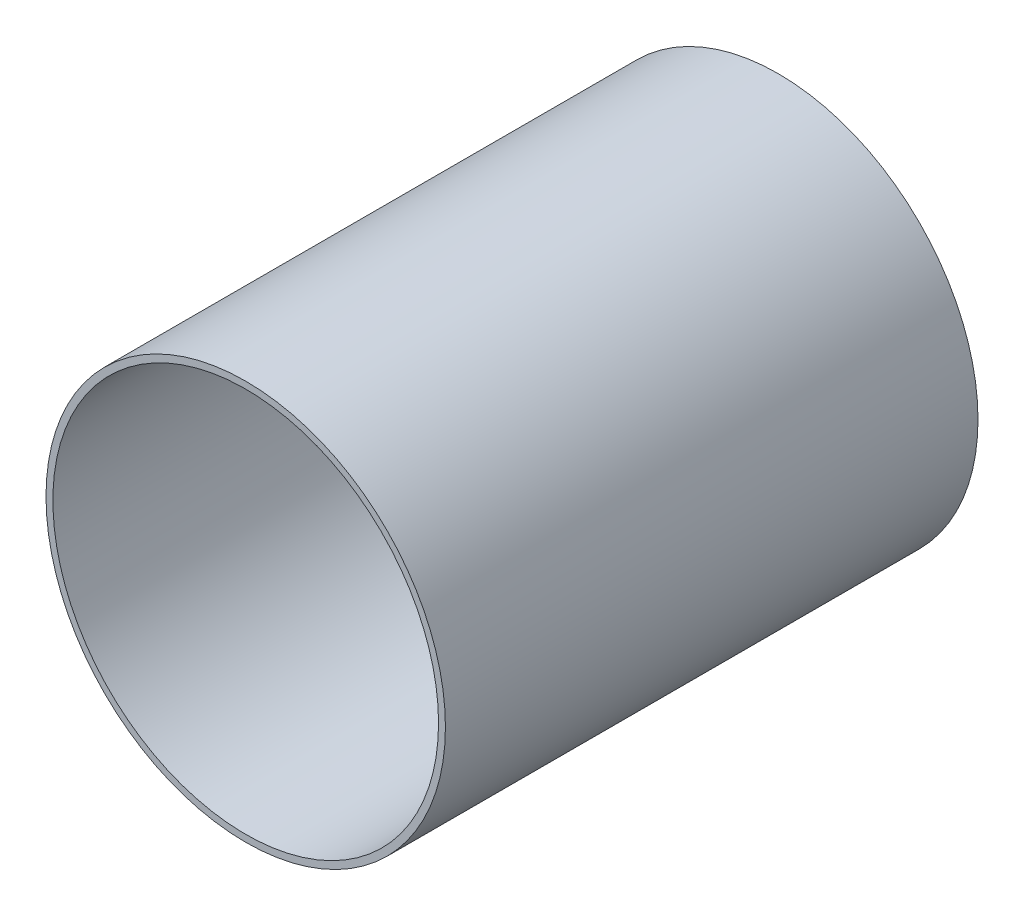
ISO-10303-21;
HEADER;
FILE_DESCRIPTION(('STEP AP214'),'2;1');
FILE_NAME('part.step','',(''),(''),'','','');
FILE_SCHEMA(('AUTOMOTIVE_DESIGN { 1 0 10303 214 1 1 1 1 }'));
ENDSEC;
DATA;
#1=APPLICATION_CONTEXT('core data for automotive mechanical design processes');
#2=APPLICATION_PROTOCOL_DEFINITION('international standard','automotive_design',2000,#1);
#3=PRODUCT_CONTEXT('',#1,'mechanical');
#4=PRODUCT('Part','Part','',(#3));
#5=PRODUCT_RELATED_PRODUCT_CATEGORY('part','',(#4));
#6=PRODUCT_DEFINITION_FORMATION('','',#4);
#7=PRODUCT_DEFINITION_CONTEXT('part definition',#1,'design');
#8=PRODUCT_DEFINITION('design','',#6,#7);
#9=PRODUCT_DEFINITION_SHAPE('','',#8);
#10=(LENGTH_UNIT() NAMED_UNIT(*) SI_UNIT(.MILLI.,.METRE.));
#11=(NAMED_UNIT(*) PLANE_ANGLE_UNIT() SI_UNIT($,.RADIAN.));
#12=(NAMED_UNIT(*) SI_UNIT($,.STERADIAN.) SOLID_ANGLE_UNIT());
#13=UNCERTAINTY_MEASURE_WITH_UNIT(LENGTH_MEASURE(1.E-05),#10,'distance_accuracy_value','');
#14=(GEOMETRIC_REPRESENTATION_CONTEXT(3) GLOBAL_UNCERTAINTY_ASSIGNED_CONTEXT((#13)) GLOBAL_UNIT_ASSIGNED_CONTEXT((#10,
#11,#12)) REPRESENTATION_CONTEXT('',''));
#15=CARTESIAN_POINT('',(0.,0.,0.));
#16=DIRECTION('',(0.,0.,1.));
#17=DIRECTION('',(1.,0.,0.));
#18=AXIS2_PLACEMENT_3D('',#15,#16,#17);
#19=CARTESIAN_POINT('',(0.,0.,203.2));
#20=DIRECTION('',(0.,0.,-1.));
#21=DIRECTION('',(-1.,0.,0.));
#22=AXIS2_PLACEMENT_3D('',#19,#20,#21);
#23=CYLINDRICAL_SURFACE('',#22,76.2);
#24=CARTESIAN_POINT('',(0.,0.,203.2));
#25=DIRECTION('',(0.,0.,1.));
#26=DIRECTION('',(1.,0.,0.));
#27=AXIS2_PLACEMENT_3D('',#24,#25,#26);
#28=CIRCLE('',#27,76.2);
#29=CARTESIAN_POINT('',(76.2,0.,203.2));
#30=VERTEX_POINT('',#29);
#31=EDGE_CURVE('E10',#30,#30,#28,.T.);
#32=ORIENTED_EDGE('',*,*,#31,.F.);
#33=EDGE_LOOP('',(#32));
#34=FACE_BOUND('',#33,.T.);
#35=CARTESIAN_POINT('',(0.,0.,0.));
#36=DIRECTION('',(0.,0.,1.));
#37=DIRECTION('',(1.,0.,0.));
#38=AXIS2_PLACEMENT_3D('',#35,#36,#37);
#39=CIRCLE('',#38,76.2);
#40=CARTESIAN_POINT('',(76.2,0.,0.));
#41=VERTEX_POINT('',#40);
#42=EDGE_CURVE('E38',#41,#41,#39,.T.);
#43=ORIENTED_EDGE('',*,*,#42,.T.);
#44=EDGE_LOOP('',(#43));
#45=FACE_BOUND('',#44,.T.);
#46=ADVANCED_FACE('F31',(#34,#45),#23,.T.);
#47=CARTESIAN_POINT('',(0.,0.,203.2));
#48=DIRECTION('',(0.,0.,1.));
#49=DIRECTION('',(1.,0.,0.));
#50=AXIS2_PLACEMENT_3D('',#47,#48,#49);
#51=PLANE('',#50);
#52=CARTESIAN_POINT('',(0.,0.,203.2));
#53=DIRECTION('',(0.,0.,1.));
#54=DIRECTION('',(1.,0.,0.));
#55=AXIS2_PLACEMENT_3D('',#52,#53,#54);
#56=CIRCLE('',#55,73.5751907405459);
#57=CARTESIAN_POINT('',(73.5751907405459,0.,203.2));
#58=VERTEX_POINT('',#57);
#59=EDGE_CURVE('E44',#58,#58,#56,.T.);
#60=ORIENTED_EDGE('',*,*,#59,.F.);
#61=EDGE_LOOP('',(#60));
#62=FACE_BOUND('',#61,.T.);
#63=ORIENTED_EDGE('',*,*,#31,.T.);
#64=EDGE_LOOP('',(#63));
#65=FACE_BOUND('',#64,.T.);
#66=ADVANCED_FACE('F60',(#62,#65),#51,.T.);
#67=CARTESIAN_POINT('',(0.,0.,0.));
#68=DIRECTION('',(0.,0.,1.));
#69=DIRECTION('',(1.,0.,0.));
#70=AXIS2_PLACEMENT_3D('',#67,#68,#69);
#71=PLANE('',#70);
#72=CARTESIAN_POINT('',(0.,0.,0.));
#73=DIRECTION('',(0.,0.,1.));
#74=DIRECTION('',(1.,0.,0.));
#75=AXIS2_PLACEMENT_3D('',#72,#73,#74);
#76=CIRCLE('',#75,73.5751907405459);
#77=CARTESIAN_POINT('',(73.5751907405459,0.,0.));
#78=VERTEX_POINT('',#77);
#79=EDGE_CURVE('E34',#78,#78,#76,.T.);
#80=ORIENTED_EDGE('',*,*,#79,.T.);
#81=EDGE_LOOP('',(#80));
#82=FACE_BOUND('',#81,.T.);
#83=ORIENTED_EDGE('',*,*,#42,.F.);
#84=EDGE_LOOP('',(#83));
#85=FACE_BOUND('',#84,.T.);
#86=ADVANCED_FACE('F51',(#82,#85),#71,.F.);
#87=CARTESIAN_POINT('',(0.,0.,-101.6));
#88=DIRECTION('',(0.,0.,1.));
#89=DIRECTION('',(1.,0.,0.));
#90=AXIS2_PLACEMENT_3D('',#87,#88,#89);
#91=CYLINDRICAL_SURFACE('',#90,73.5751907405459);
#92=CARTESIAN_POINT('',(73.5751907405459,0.,203.2));
#93=CARTESIAN_POINT('',(73.5751907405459,0.,201.083333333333));
#94=CARTESIAN_POINT('',(73.5751907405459,0.,198.966666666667));
#95=CARTESIAN_POINT('',(73.5751907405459,0.,194.733333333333));
#96=CARTESIAN_POINT('',(73.5751907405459,0.,192.616666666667));
#97=CARTESIAN_POINT('',(73.5751907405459,0.,188.383333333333));
#98=CARTESIAN_POINT('',(73.5751907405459,0.,186.266666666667));
#99=CARTESIAN_POINT('',(73.5751907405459,0.,182.033333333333));
#100=CARTESIAN_POINT('',(73.5751907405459,0.,179.916666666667));
#101=CARTESIAN_POINT('',(73.5751907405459,0.,175.683333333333));
#102=CARTESIAN_POINT('',(73.5751907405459,0.,173.566666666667));
#103=CARTESIAN_POINT('',(73.5751907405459,0.,169.333333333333));
#104=CARTESIAN_POINT('',(73.5751907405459,0.,167.216666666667));
#105=CARTESIAN_POINT('',(73.5751907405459,0.,162.983333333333));
#106=CARTESIAN_POINT('',(73.5751907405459,0.,160.866666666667));
#107=CARTESIAN_POINT('',(73.5751907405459,0.,156.633333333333));
#108=CARTESIAN_POINT('',(73.5751907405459,0.,154.516666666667));
#109=CARTESIAN_POINT('',(73.5751907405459,0.,150.283333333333));
#110=CARTESIAN_POINT('',(73.5751907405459,0.,148.166666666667));
#111=CARTESIAN_POINT('',(73.5751907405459,0.,143.933333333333));
#112=CARTESIAN_POINT('',(73.5751907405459,0.,141.816666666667));
#113=CARTESIAN_POINT('',(73.5751907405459,0.,137.583333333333));
#114=CARTESIAN_POINT('',(73.5751907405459,0.,135.466666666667));
#115=CARTESIAN_POINT('',(73.5751907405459,0.,131.233333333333));
#116=CARTESIAN_POINT('',(73.5751907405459,0.,129.116666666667));
#117=CARTESIAN_POINT('',(73.5751907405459,0.,124.883333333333));
#118=CARTESIAN_POINT('',(73.5751907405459,0.,122.766666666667));
#119=CARTESIAN_POINT('',(73.5751907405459,0.,118.533333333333));
#120=CARTESIAN_POINT('',(73.5751907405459,0.,116.416666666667));
#121=CARTESIAN_POINT('',(73.5751907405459,0.,112.183333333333));
#122=CARTESIAN_POINT('',(73.5751907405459,0.,110.066666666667));
#123=CARTESIAN_POINT('',(73.5751907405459,0.,105.833333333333));
#124=CARTESIAN_POINT('',(73.5751907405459,0.,103.716666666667));
#125=CARTESIAN_POINT('',(73.5751907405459,0.,99.4833333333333));
#126=CARTESIAN_POINT('',(73.5751907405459,0.,97.3666666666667));
#127=CARTESIAN_POINT('',(73.5751907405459,0.,93.1333333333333));
#128=CARTESIAN_POINT('',(73.5751907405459,0.,91.0166666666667));
#129=CARTESIAN_POINT('',(73.5751907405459,0.,86.7833333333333));
#130=CARTESIAN_POINT('',(73.5751907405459,0.,84.6666666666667));
#131=CARTESIAN_POINT('',(73.5751907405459,0.,80.4333333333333));
#132=CARTESIAN_POINT('',(73.5751907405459,0.,78.3166666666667));
#133=CARTESIAN_POINT('',(73.5751907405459,0.,74.0833333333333));
#134=CARTESIAN_POINT('',(73.5751907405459,0.,71.9666666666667));
#135=CARTESIAN_POINT('',(73.5751907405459,0.,67.7333333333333));
#136=CARTESIAN_POINT('',(73.5751907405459,0.,65.6166666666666));
#137=CARTESIAN_POINT('',(73.5751907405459,0.,61.3833333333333));
#138=CARTESIAN_POINT('',(73.5751907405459,0.,59.2666666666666));
#139=CARTESIAN_POINT('',(73.5751907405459,0.,55.0333333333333));
#140=CARTESIAN_POINT('',(73.5751907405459,0.,52.9166666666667));
#141=CARTESIAN_POINT('',(73.5751907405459,0.,48.6833333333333));
#142=CARTESIAN_POINT('',(73.5751907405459,0.,46.5666666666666));
#143=CARTESIAN_POINT('',(73.5751907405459,0.,42.3333333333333));
#144=CARTESIAN_POINT('',(73.5751907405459,0.,40.2166666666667));
#145=CARTESIAN_POINT('',(73.5751907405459,0.,35.9833333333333));
#146=CARTESIAN_POINT('',(73.5751907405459,0.,33.8666666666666));
#147=CARTESIAN_POINT('',(73.5751907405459,0.,29.6333333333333));
#148=CARTESIAN_POINT('',(73.5751907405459,0.,27.5166666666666));
#149=CARTESIAN_POINT('',(73.5751907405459,0.,23.2833333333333));
#150=CARTESIAN_POINT('',(73.5751907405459,0.,21.1666666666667));
#151=CARTESIAN_POINT('',(73.5751907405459,0.,16.9333333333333));
#152=CARTESIAN_POINT('',(73.5751907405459,0.,14.8166666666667));
#153=CARTESIAN_POINT('',(73.5751907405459,0.,10.5833333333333));
#154=CARTESIAN_POINT('',(73.5751907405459,0.,8.46666666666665));
#155=CARTESIAN_POINT('',(73.5751907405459,0.,4.23333333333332));
#156=CARTESIAN_POINT('',(73.5751907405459,0.,2.11666666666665));
#157=CARTESIAN_POINT('',(73.5751907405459,0.,0.));
#158=B_SPLINE_CURVE_WITH_KNOTS('',3,(#92,#93,#94,#95,#96,#97,#98,#99,#100,#101,#102,#103,#104,
#105,#106,#107,#108,#109,#110,#111,#112,#113,#114,#115,#116,#117,#118,#119,#120,#121,#122,#123,
#124,#125,#126,#127,#128,#129,#130,#131,#132,#133,#134,#135,#136,#137,#138,#139,#140,#141,#142,
#143,#144,#145,#146,#147,#148,#149,#150,#151,#152,#153,#154,#155,#156,#157),.UNSPECIFIED.,.F.,
.F.,(4,2,2,2,2,2,2,2,2,2,2,2,2,2,2,2,2,2,2,2,2,2,2,2,2,2,2,2,2,2,2,2,4),(0.,6.35000000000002,
12.7,19.05,25.4,31.75,38.1,44.45,50.8,57.15,63.5,69.85,76.2,82.55,88.9,95.25,101.6,107.95,114.3,
120.65,127.,133.35,139.7,146.05,152.4,158.75,165.1,171.45,177.8,184.15,190.5,196.85,203.2),.UNSPECIFIED.);
#159=EDGE_CURVE('BSEAM54',#58,#78,#158,.T.);
#160=ORIENTED_EDGE('',*,*,#59,.T.);
#161=ORIENTED_EDGE('',*,*,#79,.F.);
#162=ORIENTED_EDGE('',*,*,#159,.T.);
#163=ORIENTED_EDGE('',*,*,#159,.F.);
#164=EDGE_LOOP('',(#160,#162,#161,#163));
#165=FACE_BOUND('',#164,.T.);
#166=ADVANCED_FACE('F54',(#165),#91,.F.);
#167=CLOSED_SHELL('',(#46,#66,#86,#166));
#168=MANIFOLD_SOLID_BREP('B2',#167);
#169=ADVANCED_BREP_SHAPE_REPRESENTATION('',(#18,#168),#14);
#170=SHAPE_DEFINITION_REPRESENTATION(#9,#169);
ENDSEC;
END-ISO-10303-21;
